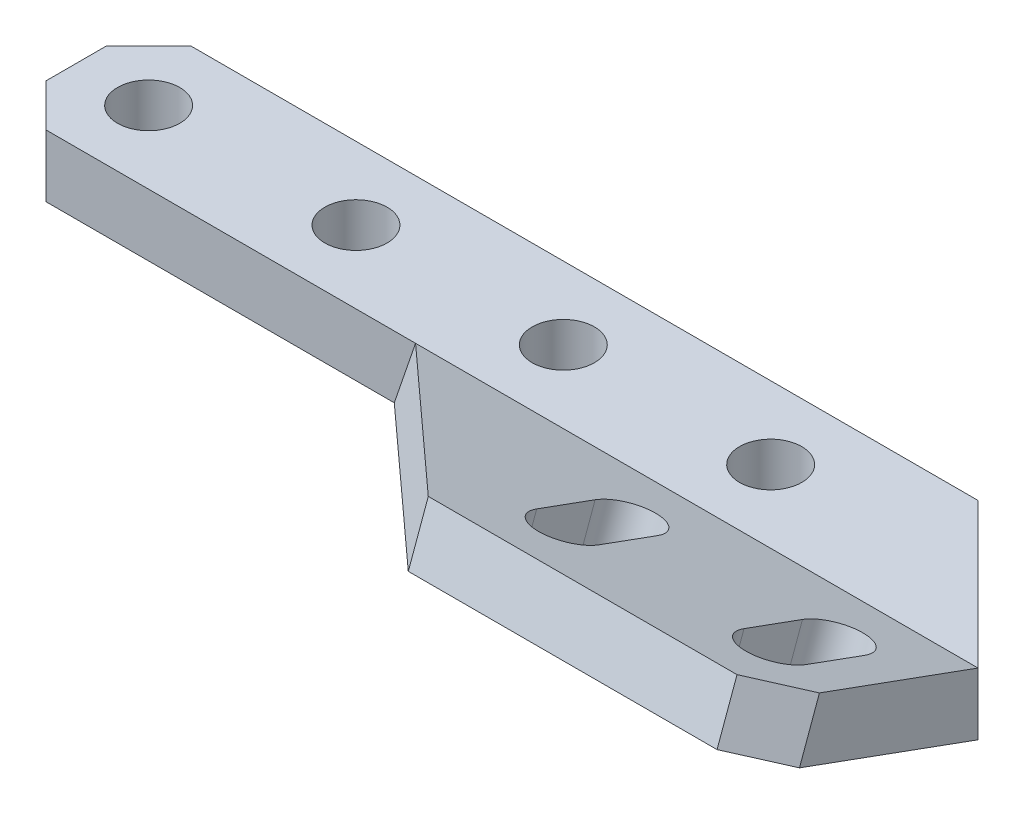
from build123d import *

# Parameters (mm, degrees)
ESQUISSE3_R             = 1.5
BOSS_EXTRU_1_DEPTH      = 3
BOSS_EXTRU_2_DEPTH      = 2.819078
ESQUISSE6_R             = 9.478612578
ENL_V_MAT_EXTRU_1_DEPTH = 44.435966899


with BuildPart() as part:
    # Esquisse3 → Boss.-Extru.1 (new body)
    with BuildSketch(Plane(origin=(0, 0, 0), x_dir=(1, 0, 0), z_dir=(0, 1, 0))):
        Polygon((33.5, -1.449747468), (33.5, 1.449747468), (31.449747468, 3.5), (-6.5, 3.5), (-13.5, -3.5), (31.449747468, -3.5), align=None)
        with Locations(Location((30, 0, 0), (0, 0, 270))):
            Circle(ESQUISSE3_R, mode=Mode.SUBTRACT)
        with Locations(Location((20, 0, 0), (0, 0, 270))):
            Circle(ESQUISSE3_R, mode=Mode.SUBTRACT)
        with Locations(Location((10, 0, 0), (0, 0, 270))):
            Circle(ESQUISSE3_R, mode=Mode.SUBTRACT)
        with Locations(Location((0, 0, 0), (0, 0, 270))):
            Circle(ESQUISSE3_R, mode=Mode.SUBTRACT)
    extrude(amount=BOSS_EXTRU_1_DEPTH)

    # Esquisse5 → Boss.-Extru.2 (add)
    with BuildSketch(Plane(origin=(0, -1.124878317, 0.409422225), x_dir=(1, 0, 0), z_dir=(0, 0.9396926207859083, -0.3420201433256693))):
        Polygon((14.652726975, -3.288924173), (3.439965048, -14.501686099), (-11.449747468, -14.501686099), (-13.5, -12.451433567), (-13.5, -3.288924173), align=None)
        with BuildLine():
            Line((-1.5, -8.001686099), (-1.5, -11.001686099))
            ThreePointArc((-1.5, -11.001686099), (0, -12.501686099), (1.5, -11.001686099))
            Line((1.5, -11.001686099), (1.5, -8.001686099))
            ThreePointArc((1.5, -8.001686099), (0, -6.501686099), (-1.5, -8.001686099))
        make_face(mode=Mode.SUBTRACT)
        with BuildLine():
            Line((-8.5, -8.001686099), (-8.5, -11.001686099))
            ThreePointArc((-8.5, -11.001686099), (-10, -12.501686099), (-11.5, -11.001686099))
            Line((-11.5, -11.001686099), (-11.5, -8.001686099))
            ThreePointArc((-11.5, -8.001686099), (-10, -6.501686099), (-8.5, -8.001686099))
        make_face(mode=Mode.SUBTRACT)
    extrude(amount=BOSS_EXTRU_2_DEPTH)

    # Esquisse6 → Enl_v. mat.-Extru.1 (cut, through all)
    with BuildSketch(Plane(origin=(-5, 0, -5), x_dir=(-0.7071067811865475, 0, 0.7071067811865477), z_dir=(-0.7071067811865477, 0, -0.7071067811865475))):
        with Locations((10.198089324, -0.262268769)):
            Circle(ESQUISSE6_R)
    extrude(amount=ENL_V_MAT_EXTRU_1_DEPTH, mode=Mode.SUBTRACT)


with BuildPart() as body_2:
    # Sym_trie1: mirrored copy
    add(part.part.mirror(Plane(origin=(0, 0, 0), x_dir=(0, 0, 1), z_dir=(1, 0, 0))))


solid = body_2.part
